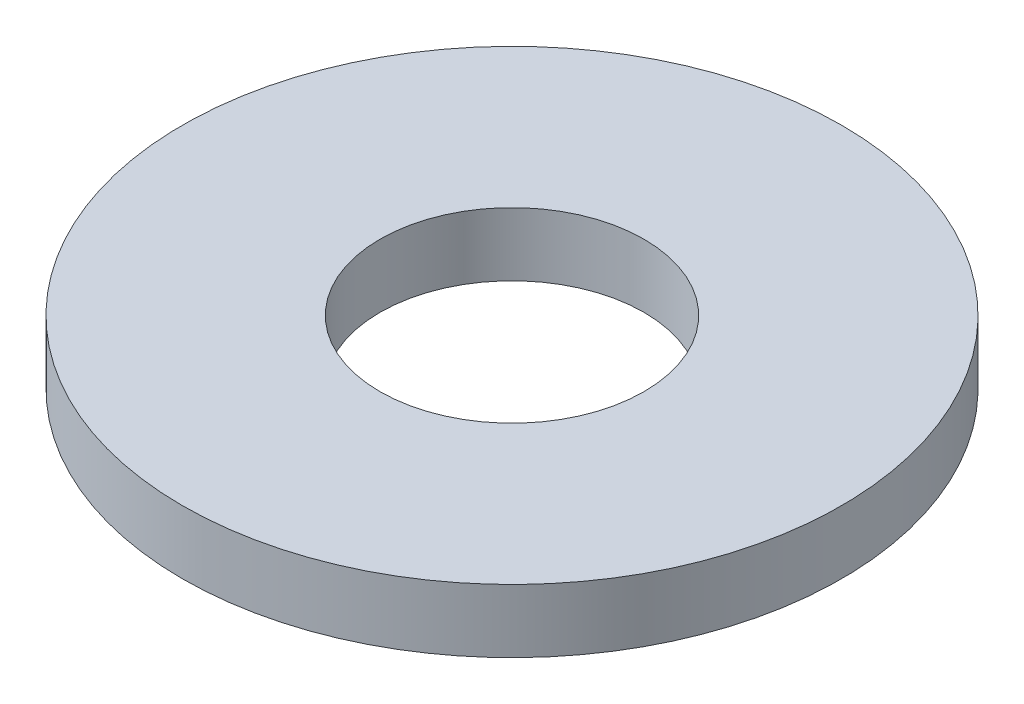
from build123d import *

# Parameters (mm, degrees)
SKETCH1_R           = 3.9624
BOSS_EXTRUDE1_DEPTH = 0.762
SKETCH5_R           = 1.5875
CUT_EXTRUDE1_DEPTH  = 6.655251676


with BuildPart() as part:
    # Sketch1 → Boss-Extrude1 (new body)
    with BuildSketch(Plane(origin=(0, 0, 0), x_dir=(1, 0, 0), z_dir=(0, 1, 0))):
        with Locations(Location((0, 0, 0), (0, 0, 90))):
            Circle(SKETCH1_R)
    extrude(amount=BOSS_EXTRUDE1_DEPTH)

    # Sketch5 → Cut-Extrude1 (cut, through all)
    with BuildSketch(Plane(origin=(0, 0.762, 0), x_dir=(-1, 0, 0), z_dir=(0, 1, 0))):
        with Locations(Location((0, 0, 0), (0, 0, 90))):
            Circle(SKETCH5_R)
    extrude(amount=-CUT_EXTRUDE1_DEPTH, mode=Mode.SUBTRACT)


solid = part.part
